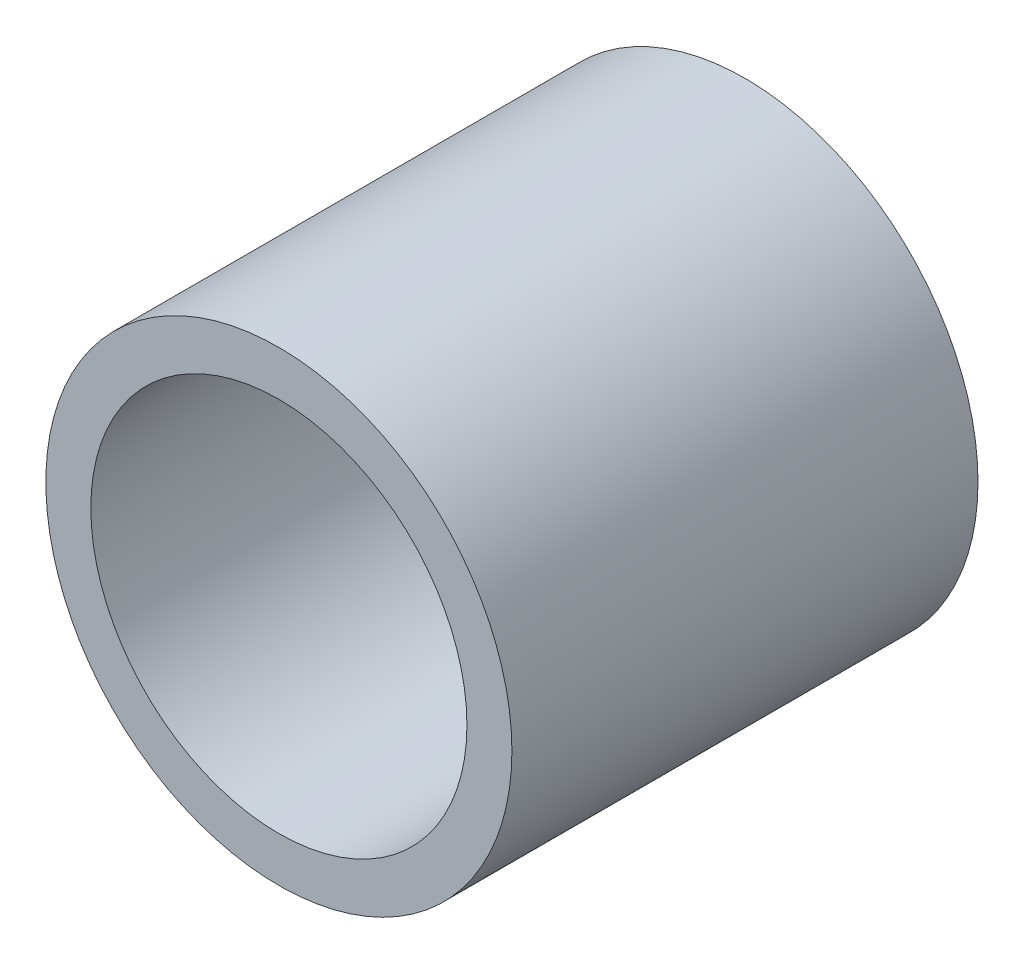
ISO-10303-21;
HEADER;
FILE_DESCRIPTION(('STEP AP214'),'2;1');
FILE_NAME('part.step','',(''),(''),'','','');
FILE_SCHEMA(('AUTOMOTIVE_DESIGN { 1 0 10303 214 1 1 1 1 }'));
ENDSEC;
DATA;
#1=APPLICATION_CONTEXT('core data for automotive mechanical design processes');
#2=APPLICATION_PROTOCOL_DEFINITION('international standard','automotive_design',2000,#1);
#3=PRODUCT_CONTEXT('',#1,'mechanical');
#4=PRODUCT('Part','Part','',(#3));
#5=PRODUCT_RELATED_PRODUCT_CATEGORY('part','',(#4));
#6=PRODUCT_DEFINITION_FORMATION('','',#4);
#7=PRODUCT_DEFINITION_CONTEXT('part definition',#1,'design');
#8=PRODUCT_DEFINITION('design','',#6,#7);
#9=PRODUCT_DEFINITION_SHAPE('','',#8);
#10=(LENGTH_UNIT() NAMED_UNIT(*) SI_UNIT(.MILLI.,.METRE.));
#11=(NAMED_UNIT(*) PLANE_ANGLE_UNIT() SI_UNIT($,.RADIAN.));
#12=(NAMED_UNIT(*) SI_UNIT($,.STERADIAN.) SOLID_ANGLE_UNIT());
#13=UNCERTAINTY_MEASURE_WITH_UNIT(LENGTH_MEASURE(1.E-05),#10,'distance_accuracy_value','');
#14=(GEOMETRIC_REPRESENTATION_CONTEXT(3) GLOBAL_UNCERTAINTY_ASSIGNED_CONTEXT((#13)) GLOBAL_UNIT_ASSIGNED_CONTEXT((#10,
#11,#12)) REPRESENTATION_CONTEXT('',''));
#15=CARTESIAN_POINT('',(0.,0.,0.));
#16=DIRECTION('',(0.,0.,1.));
#17=DIRECTION('',(1.,0.,0.));
#18=AXIS2_PLACEMENT_3D('',#15,#16,#17);
#19=CARTESIAN_POINT('',(0.,0.,10.));
#20=DIRECTION('',(0.,0.,1.));
#21=DIRECTION('',(1.,0.,0.));
#22=AXIS2_PLACEMENT_3D('',#19,#20,#21);
#23=PLANE('',#22);
#24=CARTESIAN_POINT('',(0.,0.,10.));
#25=DIRECTION('',(0.,0.,1.));
#26=DIRECTION('',(1.,0.,0.));
#27=AXIS2_PLACEMENT_3D('',#24,#25,#26);
#28=CIRCLE('',#27,5.);
#29=CARTESIAN_POINT('',(5.,0.,10.));
#30=VERTEX_POINT('',#29);
#31=EDGE_CURVE('E10',#30,#30,#28,.T.);
#32=ORIENTED_EDGE('',*,*,#31,.T.);
#33=EDGE_LOOP('',(#32));
#34=FACE_BOUND('',#33,.T.);
#35=CARTESIAN_POINT('',(0.,0.,10.));
#36=DIRECTION('',(0.,0.,1.));
#37=DIRECTION('',(1.,0.,0.));
#38=AXIS2_PLACEMENT_3D('',#35,#36,#37);
#39=CIRCLE('',#38,4.035);
#40=CARTESIAN_POINT('',(4.035,0.,10.));
#41=VERTEX_POINT('',#40);
#42=EDGE_CURVE('E43',#41,#41,#39,.T.);
#43=ORIENTED_EDGE('',*,*,#42,.F.);
#44=EDGE_LOOP('',(#43));
#45=FACE_BOUND('',#44,.T.);
#46=ADVANCED_FACE('F32',(#34,#45),#23,.T.);
#47=CARTESIAN_POINT('',(0.,0.,0.));
#48=DIRECTION('',(0.,0.,1.));
#49=DIRECTION('',(1.,0.,0.));
#50=AXIS2_PLACEMENT_3D('',#47,#48,#49);
#51=PLANE('',#50);
#52=CARTESIAN_POINT('',(0.,0.,0.));
#53=DIRECTION('',(0.,0.,1.));
#54=DIRECTION('',(1.,0.,0.));
#55=AXIS2_PLACEMENT_3D('',#52,#53,#54);
#56=CIRCLE('',#55,5.);
#57=CARTESIAN_POINT('',(5.,0.,0.));
#58=VERTEX_POINT('',#57);
#59=EDGE_CURVE('E36',#58,#58,#56,.T.);
#60=ORIENTED_EDGE('',*,*,#59,.F.);
#61=EDGE_LOOP('',(#60));
#62=FACE_BOUND('',#61,.T.);
#63=CARTESIAN_POINT('',(0.,0.,0.));
#64=DIRECTION('',(0.,0.,1.));
#65=DIRECTION('',(1.,0.,0.));
#66=AXIS2_PLACEMENT_3D('',#63,#64,#65);
#67=CIRCLE('',#66,4.035);
#68=CARTESIAN_POINT('',(4.035,0.,0.));
#69=VERTEX_POINT('',#68);
#70=EDGE_CURVE('E45',#69,#69,#67,.T.);
#71=ORIENTED_EDGE('',*,*,#70,.T.);
#72=EDGE_LOOP('',(#71));
#73=FACE_BOUND('',#72,.T.);
#74=ADVANCED_FACE('F55',(#62,#73),#51,.F.);
#75=CARTESIAN_POINT('',(0.,0.,10.));
#76=DIRECTION('',(0.,0.,-1.));
#77=DIRECTION('',(-1.,0.,0.));
#78=AXIS2_PLACEMENT_3D('',#75,#76,#77);
#79=CYLINDRICAL_SURFACE('',#78,5.);
#80=ORIENTED_EDGE('',*,*,#31,.F.);
#81=EDGE_LOOP('',(#80));
#82=FACE_BOUND('',#81,.T.);
#83=ORIENTED_EDGE('',*,*,#59,.T.);
#84=EDGE_LOOP('',(#83));
#85=FACE_BOUND('',#84,.T.);
#86=ADVANCED_FACE('F34',(#82,#85),#79,.T.);
#87=CARTESIAN_POINT('',(0.,0.,10.));
#88=DIRECTION('',(0.,0.,-1.));
#89=DIRECTION('',(-1.,0.,0.));
#90=AXIS2_PLACEMENT_3D('',#87,#88,#89);
#91=CYLINDRICAL_SURFACE('',#90,4.035);
#92=ORIENTED_EDGE('',*,*,#42,.T.);
#93=EDGE_LOOP('',(#92));
#94=FACE_BOUND('',#93,.T.);
#95=ORIENTED_EDGE('',*,*,#70,.F.);
#96=EDGE_LOOP('',(#95));
#97=FACE_BOUND('',#96,.T.);
#98=ADVANCED_FACE('F51',(#94,#97),#91,.F.);
#99=CLOSED_SHELL('',(#46,#74,#86,#98));
#100=MANIFOLD_SOLID_BREP('B2',#99);
#101=ADVANCED_BREP_SHAPE_REPRESENTATION('',(#18,#100),#14);
#102=SHAPE_DEFINITION_REPRESENTATION(#9,#101);
ENDSEC;
END-ISO-10303-21;
